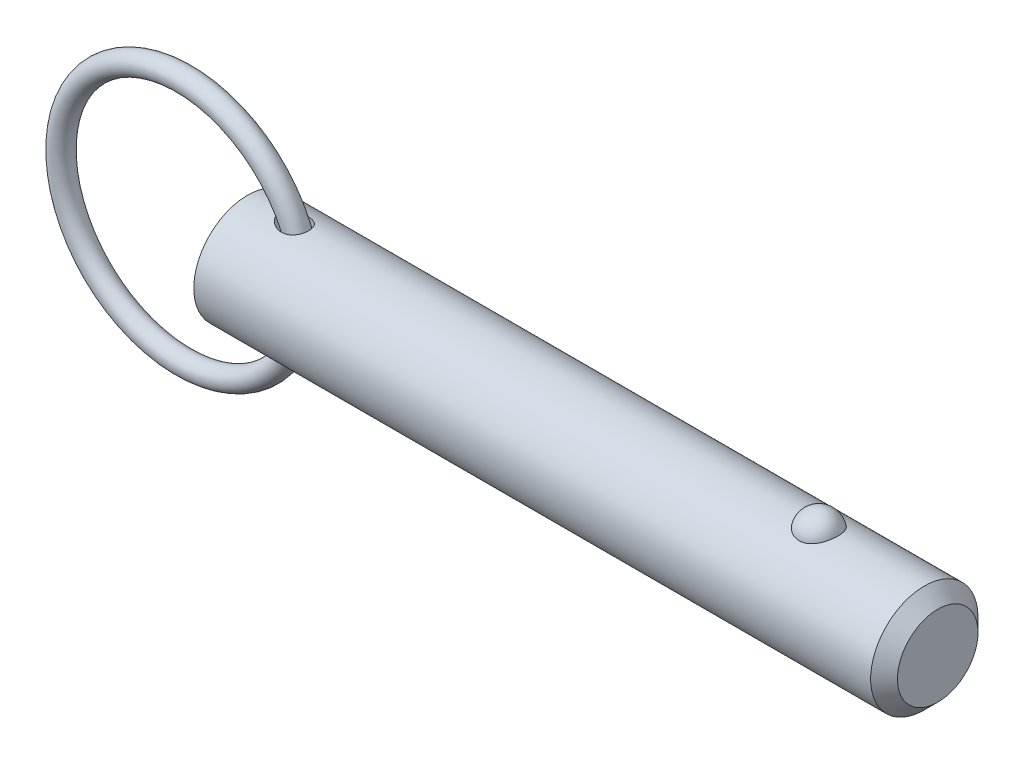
ISO-10303-21;
HEADER;
FILE_DESCRIPTION(('STEP AP214'),'2;1');
FILE_NAME('part.step','',(''),(''),'','','');
FILE_SCHEMA(('AUTOMOTIVE_DESIGN { 1 0 10303 214 1 1 1 1 }'));
ENDSEC;
DATA;
#1=APPLICATION_CONTEXT('core data for automotive mechanical design processes');
#2=APPLICATION_PROTOCOL_DEFINITION('international standard','automotive_design',2000,#1);
#3=PRODUCT_CONTEXT('',#1,'mechanical');
#4=PRODUCT('Part','Part','',(#3));
#5=PRODUCT_RELATED_PRODUCT_CATEGORY('part','',(#4));
#6=PRODUCT_DEFINITION_FORMATION('','',#4);
#7=PRODUCT_DEFINITION_CONTEXT('part definition',#1,'design');
#8=PRODUCT_DEFINITION('design','',#6,#7);
#9=PRODUCT_DEFINITION_SHAPE('','',#8);
#10=(LENGTH_UNIT() NAMED_UNIT(*) SI_UNIT(.MILLI.,.METRE.));
#11=(NAMED_UNIT(*) PLANE_ANGLE_UNIT() SI_UNIT($,.RADIAN.));
#12=(NAMED_UNIT(*) SI_UNIT($,.STERADIAN.) SOLID_ANGLE_UNIT());
#13=UNCERTAINTY_MEASURE_WITH_UNIT(LENGTH_MEASURE(1.E-05),#10,'distance_accuracy_value','');
#14=(GEOMETRIC_REPRESENTATION_CONTEXT(3) GLOBAL_UNCERTAINTY_ASSIGNED_CONTEXT((#13)) GLOBAL_UNIT_ASSIGNED_CONTEXT((#10,
#11,#12)) REPRESENTATION_CONTEXT('',''));
#15=CARTESIAN_POINT('',(0.,0.,0.));
#16=DIRECTION('',(0.,0.,1.));
#17=DIRECTION('',(1.,0.,0.));
#18=AXIS2_PLACEMENT_3D('',#15,#16,#17);
#19=CARTESIAN_POINT('',(-6.5973878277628,0.,0.));
#20=DIRECTION('',(0.,0.,1.));
#21=DIRECTION('',(1.,0.,0.));
#22=AXIS2_PLACEMENT_3D('',#19,#20,#21);
#23=TOROIDAL_SURFACE('',#22,12.7,1.111);
#24=CARTESIAN_POINT('',(7.21361217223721,0.,0.));
#25=VERTEX_POINT('',#24);
#26=VERTEX_LOOP('',#25);
#27=FACE_BOUND('',#26,.T.);
#28=ADVANCED_FACE('P0_F12',(#27),#23,.T.);
#29=CLOSED_SHELL('',(#28));
#30=MANIFOLD_SOLID_BREP('P0_B1',#29);
#31=CARTESIAN_POINT('',(0.,0.,0.));
#32=DIRECTION('',(1.,0.,0.));
#33=DIRECTION('',(0.,0.,-1.));
#34=AXIS2_PLACEMENT_3D('',#31,#32,#33);
#35=CYLINDRICAL_SURFACE('',#34,5.555);
#36=CARTESIAN_POINT('',(3.4079629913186,5.52646850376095,-0.562290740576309));
#37=CARTESIAN_POINT('',(3.45038002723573,5.51879026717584,-0.637753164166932));
#38=CARTESIAN_POINT('',(3.50032814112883,5.50998541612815,-0.708891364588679));
#39=CARTESIAN_POINT('',(3.61174203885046,5.49132550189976,-0.841353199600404));
#40=CARTESIAN_POINT('',(3.67323300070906,5.48146816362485,-0.902654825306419));
#41=CARTESIAN_POINT('',(3.80437942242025,5.46186986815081,-1.01449227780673));
#42=CARTESIAN_POINT('',(3.87396236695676,5.45212862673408,-1.06511378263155));
#43=CARTESIAN_POINT('',(4.01965973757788,5.43359578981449,-1.15594541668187));
#44=CARTESIAN_POINT('',(4.09577226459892,5.42480391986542,-1.19615855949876));
#45=CARTESIAN_POINT('',(4.26620236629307,5.40764958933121,-1.27165209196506));
#46=CARTESIAN_POINT('',(4.36143030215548,5.3996073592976,-1.30496908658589));
#47=CARTESIAN_POINT('',(4.55632904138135,5.38707461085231,-1.35578120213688));
#48=CARTESIAN_POINT('',(4.65600230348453,5.38258608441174,-1.37326745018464));
#49=CARTESIAN_POINT('',(4.85802759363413,5.37803111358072,-1.3910078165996));
#50=CARTESIAN_POINT('',(4.96039620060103,5.37800782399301,-1.39109376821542));
#51=CARTESIAN_POINT('',(5.16321961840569,5.38288845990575,-1.37209481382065));
#52=CARTESIAN_POINT('',(5.26367660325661,5.38778639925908,-1.3530331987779));
#53=CARTESIAN_POINT('',(5.44616808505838,5.40112654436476,-1.29866014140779));
#54=CARTESIAN_POINT('',(5.52893514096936,5.40904875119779,-1.26567968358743));
#55=CARTESIAN_POINT('',(5.68656142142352,5.4273273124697,-1.18484144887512));
#56=CARTESIAN_POINT('',(5.76142575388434,5.43768208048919,-1.13699336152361));
#57=CARTESIAN_POINT('',(5.8928378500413,5.45821422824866,-1.03362464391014));
#58=CARTESIAN_POINT('',(5.95048930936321,5.4682911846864,-0.979480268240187));
#59=CARTESIAN_POINT('',(6.05543937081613,5.48805232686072,-0.86188793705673));
#60=CARTESIAN_POINT('',(6.10274018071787,5.4977365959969,-0.798441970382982));
#61=CARTESIAN_POINT('',(6.18429732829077,5.51527779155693,-0.666351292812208));
#62=CARTESIAN_POINT('',(6.21893047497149,5.52318421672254,-0.597945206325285));
#63=CARTESIAN_POINT('',(6.27643902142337,5.53669785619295,-0.456146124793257));
#64=CARTESIAN_POINT('',(6.299314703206,5.54230512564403,-0.38275324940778));
#65=CARTESIAN_POINT('',(6.33280284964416,5.55061821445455,-0.232999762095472));
#66=CARTESIAN_POINT('',(6.34340498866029,5.55332159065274,-0.156636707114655));
#67=CARTESIAN_POINT('',(6.35208224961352,5.55552923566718,-0.00315477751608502));
#68=CARTESIAN_POINT('',(6.3501570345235,5.55503341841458,0.0739641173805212));
#69=CARTESIAN_POINT('',(6.33379320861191,5.55088854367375,0.227029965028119));
#70=CARTESIAN_POINT('',(6.31931424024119,5.54722931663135,0.302972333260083));
#71=CARTESIAN_POINT('',(6.27810810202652,5.53713917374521,0.451265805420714));
#72=CARTESIAN_POINT('',(6.25138106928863,5.53070828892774,0.52361694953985));
#73=CARTESIAN_POINT('',(6.18634700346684,5.51578851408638,0.662556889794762));
#74=CARTESIAN_POINT('',(6.14805666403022,5.50730259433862,0.729153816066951));
#75=CARTESIAN_POINT('',(6.0608417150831,5.4892059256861,0.854797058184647));
#76=CARTESIAN_POINT('',(6.01191805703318,5.47959527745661,0.913844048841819));
#77=CARTESIAN_POINT('',(5.90496974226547,5.46035411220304,1.0225462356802));
#78=CARTESIAN_POINT('',(5.84698163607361,5.45072382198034,1.07223745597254));
#79=CARTESIAN_POINT('',(5.72342907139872,5.43245016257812,1.16128533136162));
#80=CARTESIAN_POINT('',(5.65786492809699,5.42380675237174,1.20064241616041));
#81=CARTESIAN_POINT('',(5.52033184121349,5.40830592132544,1.26865612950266));
#82=CARTESIAN_POINT('',(5.44830127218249,5.40146883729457,1.2971923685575));
#83=CARTESIAN_POINT('',(5.30051649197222,5.39032432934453,1.34275086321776));
#84=CARTESIAN_POINT('',(5.22476137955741,5.38601752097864,1.35977031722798));
#85=CARTESIAN_POINT('',(5.06697568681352,5.38004503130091,1.3832203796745));
#86=CARTESIAN_POINT('',(4.98483834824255,5.37854992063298,1.38896799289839));
#87=CARTESIAN_POINT('',(4.82062075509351,5.37866467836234,1.38851901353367));
#88=CARTESIAN_POINT('',(4.73854053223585,5.38027567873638,1.38231806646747));
#89=CARTESIAN_POINT('',(4.56659703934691,5.38661928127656,1.35740374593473));
#90=CARTESIAN_POINT('',(4.47694676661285,5.39169506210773,1.33731128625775));
#91=CARTESIAN_POINT('',(4.30168169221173,5.40457769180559,1.28425210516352));
#92=CARTESIAN_POINT('',(4.2160714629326,5.41238755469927,1.25127117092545));
#93=CARTESIAN_POINT('',(4.04117722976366,5.43085841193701,1.16867508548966));
#94=CARTESIAN_POINT('',(3.95261220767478,5.44174460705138,1.11757796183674));
#95=CARTESIAN_POINT('',(3.78568183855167,5.46440376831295,1.00091858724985));
#96=CARTESIAN_POINT('',(3.70730710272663,5.47617590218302,0.935369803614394));
#97=CARTESIAN_POINT('',(3.5829937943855,5.49603821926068,0.809043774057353));
#98=CARTESIAN_POINT('',(3.5339020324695,5.50429522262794,0.751392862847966));
#99=CARTESIAN_POINT('',(3.44556991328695,5.51963490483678,0.628847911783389));
#100=CARTESIAN_POINT('',(3.4063138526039,5.52671944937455,0.56396565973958));
#101=CARTESIAN_POINT('',(3.34553998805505,5.5379053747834,0.439181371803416));
#102=CARTESIAN_POINT('',(3.32216705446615,5.5423057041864,0.380214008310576));
#103=CARTESIAN_POINT('',(3.2854368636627,5.54928356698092,0.259119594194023));
#104=CARTESIAN_POINT('',(3.27207322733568,5.5518622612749,0.196994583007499));
#105=CARTESIAN_POINT('',(3.25633559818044,5.5549036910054,0.0710541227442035));
#106=CARTESIAN_POINT('',(3.25400356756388,5.5553583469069,0.00723314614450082));
#107=CARTESIAN_POINT('',(3.26064251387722,5.55407150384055,-0.119787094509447));
#108=CARTESIAN_POINT('',(3.26961302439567,5.55233009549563,-0.182986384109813));
#109=CARTESIAN_POINT('',(3.29666795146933,5.54714559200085,-0.300518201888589));
#110=CARTESIAN_POINT('',(3.31373453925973,5.54389322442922,-0.355099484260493));
#111=CARTESIAN_POINT('',(3.35543396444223,5.53607951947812,-0.461174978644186));
#112=CARTESIAN_POINT('',(3.38007019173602,5.5315175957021,-0.512667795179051));
#113=CARTESIAN_POINT('',(3.4079629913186,5.52646850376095,-0.562290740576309));
#114=B_SPLINE_CURVE_WITH_KNOTS('',3,(#36,#37,#38,#39,#40,#41,#42,#43,#44,#45,#46,#47,#48,#49,
#50,#51,#52,#53,#54,#55,#56,#57,#58,#59,#60,#61,#62,#63,#64,#65,#66,#67,#68,#69,#70,#71,#72,#73,
#74,#75,#76,#77,#78,#79,#80,#81,#82,#83,#84,#85,#86,#87,#88,#89,#90,#91,#92,#93,#94,#95,#96,#97,
#98,#99,#100,#101,#102,#103,#104,#105,#106,#107,#108,#109,#110,#111,#112,#113),.UNSPECIFIED.,
.T.,.F.,(4,2,2,2,2,2,2,2,2,2,2,2,2,2,2,2,2,2,2,2,2,2,2,2,2,2,2,2,2,2,2,2,2,2,2,2,2,2,4),(0.,
0.260459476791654,0.521493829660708,0.780346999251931,1.03912513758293,1.34137402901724,
1.64379222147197,1.94913302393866,2.25410286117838,2.52092363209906,2.78757087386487,
3.0255756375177,3.26352958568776,3.49368251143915,3.72382991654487,3.95417080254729,
4.18451788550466,4.41560824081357,4.64669600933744,4.87745174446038,5.10818684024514,
5.33801446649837,5.56783253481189,5.80013729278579,6.03249854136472,6.27855081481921,
6.52469277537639,6.79963372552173,7.07487872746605,7.38193573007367,7.68870779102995,
7.91639390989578,8.14371416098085,8.33366541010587,8.52349549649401,8.71404708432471,
8.90459080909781,9.07578823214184,9.24706243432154),.UNSPECIFIED.);
#115=CARTESIAN_POINT('',(3.4079629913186,5.52646850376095,-0.562290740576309));
#116=VERTEX_POINT('',#115);
#117=EDGE_CURVE('P1_E40',#116,#116,#114,.T.);
#118=ORIENTED_EDGE('',*,*,#117,.T.);
#119=EDGE_LOOP('',(#118));
#120=FACE_BOUND('',#119,.T.);
#121=CARTESIAN_POINT('',(70.03125,0.,0.));
#122=DIRECTION('',(1.,0.,0.));
#123=DIRECTION('',(0.,0.,-1.));
#124=AXIS2_PLACEMENT_3D('',#121,#122,#123);
#125=CIRCLE('',#124,5.555);
#126=CARTESIAN_POINT('',(70.03125,0.,-5.555));
#127=VERTEX_POINT('',#126);
#128=EDGE_CURVE('P1_E25',#127,#127,#125,.T.);
#129=ORIENTED_EDGE('',*,*,#128,.F.);
#130=EDGE_LOOP('',(#129));
#131=FACE_BOUND('',#130,.T.);
#132=CARTESIAN_POINT('',(0.,0.,0.));
#133=DIRECTION('',(1.,0.,0.));
#134=DIRECTION('',(0.,0.,-1.));
#135=AXIS2_PLACEMENT_3D('',#132,#133,#134);
#136=CIRCLE('',#135,5.555);
#137=CARTESIAN_POINT('',(0.,0.,-5.555));
#138=VERTEX_POINT('',#137);
#139=EDGE_CURVE('P1_E9',#138,#138,#136,.T.);
#140=ORIENTED_EDGE('',*,*,#139,.T.);
#141=EDGE_LOOP('',(#140));
#142=FACE_BOUND('',#141,.T.);
#143=CARTESIAN_POINT('',(59.1186264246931,5.16741224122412,2.03859650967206));
#144=CARTESIAN_POINT('',(59.0129492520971,5.16740893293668,2.03859990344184));
#145=CARTESIAN_POINT('',(58.90729894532,5.17079470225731,2.03008306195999));
#146=CARTESIAN_POINT('',(58.6991419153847,5.18392795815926,1.99630721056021));
#147=CARTESIAN_POINT('',(58.5966344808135,5.19367399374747,1.97105201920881));
#148=CARTESIAN_POINT('',(58.3977710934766,5.21839168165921,1.90463997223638));
#149=CARTESIAN_POINT('',(58.3014064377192,5.23335573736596,1.86350622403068));
#150=CARTESIAN_POINT('',(58.1170804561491,5.26688076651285,1.76652592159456));
#151=CARTESIAN_POINT('',(58.0291207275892,5.28544242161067,1.71067657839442));
#152=CARTESIAN_POINT('',(57.861265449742,5.32479845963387,1.58399959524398));
#153=CARTESIAN_POINT('',(57.7816656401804,5.34564089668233,1.5127954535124));
#154=CARTESIAN_POINT('',(57.6351290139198,5.38697258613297,1.3582858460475));
#155=CARTESIAN_POINT('',(57.568194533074,5.40746177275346,1.27497815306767));
#156=CARTESIAN_POINT('',(57.4456103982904,5.44694508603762,1.09440293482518));
#157=CARTESIAN_POINT('',(57.3905989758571,5.46583143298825,0.996677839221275));
#158=CARTESIAN_POINT('',(57.2969376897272,5.49908030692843,0.792961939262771));
#159=CARTESIAN_POINT('',(57.2582894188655,5.513442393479,0.686970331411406));
#160=CARTESIAN_POINT('',(57.1976807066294,5.536358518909,0.468019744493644));
#161=CARTESIAN_POINT('',(57.1759725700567,5.54482455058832,0.354981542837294));
#162=CARTESIAN_POINT('',(57.1506362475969,5.55473324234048,0.126595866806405));
#163=CARTESIAN_POINT('',(57.1470077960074,5.55617600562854,0.0112484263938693));
#164=CARTESIAN_POINT('',(57.1578817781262,5.55189984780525,-0.218011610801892));
#165=CARTESIAN_POINT('',(57.1723151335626,5.54620821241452,-0.331928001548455));
#166=CARTESIAN_POINT('',(57.218903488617,5.52828920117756,-0.555544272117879));
#167=CARTESIAN_POINT('',(57.2510588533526,5.5160616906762,-0.665244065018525));
#168=CARTESIAN_POINT('',(57.3324883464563,5.48630779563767,-0.877469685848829));
#169=CARTESIAN_POINT('',(57.3817816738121,5.4687754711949,-0.979987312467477));
#170=CARTESIAN_POINT('',(57.4964785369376,5.43024700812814,-1.1748697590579));
#171=CARTESIAN_POINT('',(57.5618831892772,5.4092506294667,-1.26723387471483));
#172=CARTESIAN_POINT('',(57.7075712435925,5.36600927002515,-1.4394013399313));
#173=CARTESIAN_POINT('',(57.7878859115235,5.34376173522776,-1.51917763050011));
#174=CARTESIAN_POINT('',(57.9614520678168,5.30057971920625,-1.66360338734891));
#175=CARTESIAN_POINT('',(58.054702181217,5.27964509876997,-1.72825445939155));
#176=CARTESIAN_POINT('',(58.2493939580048,5.24205250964,-1.83909478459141));
#177=CARTESIAN_POINT('',(58.3505900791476,5.22530519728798,-1.88568407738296));
#178=CARTESIAN_POINT('',(58.5601552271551,5.19750919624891,-1.96100802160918));
#179=CARTESIAN_POINT('',(58.6685215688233,5.1864583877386,-1.98974931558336));
#180=CARTESIAN_POINT('',(58.8834989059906,5.17184410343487,-2.02742262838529));
#181=CARTESIAN_POINT('',(58.989925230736,5.16793282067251,-2.03727608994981));
#182=CARTESIAN_POINT('',(59.2029925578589,5.16698995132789,-2.03966777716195));
#183=CARTESIAN_POINT('',(59.3096335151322,5.16995704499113,-2.03220932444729));
#184=CARTESIAN_POINT('',(59.5167730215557,5.18222383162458,-2.00071170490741));
#185=CARTESIAN_POINT('',(59.6173599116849,5.19133213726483,-1.97717337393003));
#186=CARTESIAN_POINT('',(59.8130141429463,5.21467637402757,-1.91475248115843));
#187=CARTESIAN_POINT('',(59.9080810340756,5.22891272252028,-1.8758686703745));
#188=CARTESIAN_POINT('',(60.0923711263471,5.26137066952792,-1.78282713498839));
#189=CARTESIAN_POINT('',(60.1814190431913,5.27967329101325,-1.72835124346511));
#190=CARTESIAN_POINT('',(60.3492880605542,5.31817411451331,-1.6059748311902));
#191=CARTESIAN_POINT('',(60.4281068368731,5.33837274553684,-1.53807126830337));
#192=CARTESIAN_POINT('',(60.5775156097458,5.37968287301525,-1.38688970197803));
#193=CARTESIAN_POINT('',(60.6475058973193,5.40079011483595,-1.30301744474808));
#194=CARTESIAN_POINT('',(60.7730125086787,5.44074401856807,-1.12458170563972));
#195=CARTESIAN_POINT('',(60.8285262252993,5.4595902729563,-1.03001630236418));
#196=CARTESIAN_POINT('',(60.9255507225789,5.49369849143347,-0.829439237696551));
#197=CARTESIAN_POINT('',(60.9665483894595,5.50882422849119,-0.72315564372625));
#198=CARTESIAN_POINT('',(61.0311250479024,5.53310911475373,-0.504772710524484));
#199=CARTESIAN_POINT('',(61.0547036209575,5.54226812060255,-0.392673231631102));
#200=CARTESIAN_POINT('',(61.084013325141,5.55370358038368,-0.165459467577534));
#201=CARTESIAN_POINT('',(61.0896884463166,5.55595843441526,-0.0503368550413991));
#202=CARTESIAN_POINT('',(61.082916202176,5.55329317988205,0.17928866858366));
#203=CARTESIAN_POINT('',(61.0704690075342,5.54837313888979,0.293791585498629));
#204=CARTESIAN_POINT('',(61.0277798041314,5.53189037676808,0.518526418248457));
#205=CARTESIAN_POINT('',(60.997598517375,5.5203503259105,0.628771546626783));
#206=CARTESIAN_POINT('',(60.9200962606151,5.49182453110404,0.842318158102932));
#207=CARTESIAN_POINT('',(60.8727743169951,5.47483847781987,0.945619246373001));
#208=CARTESIAN_POINT('',(60.7617204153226,5.43710633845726,1.14281571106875));
#209=CARTESIAN_POINT('',(60.6979215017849,5.41634501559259,1.23667048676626));
#210=CARTESIAN_POINT('',(60.5553577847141,5.37334572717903,1.41185243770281));
#211=CARTESIAN_POINT('',(60.4765932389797,5.35110778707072,1.49317982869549));
#212=CARTESIAN_POINT('',(60.3064234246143,5.30779474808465,1.64049162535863));
#213=CARTESIAN_POINT('',(60.2151002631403,5.28671324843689,1.7065687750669));
#214=CARTESIAN_POINT('',(60.0217390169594,5.24804852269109,1.82201372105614));
#215=CARTESIAN_POINT('',(59.9197005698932,5.23046541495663,1.87138095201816));
#216=CARTESIAN_POINT('',(59.7036187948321,5.20042692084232,1.95335298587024));
#217=CARTESIAN_POINT('',(59.589260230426,5.18820192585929,1.98521734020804));
#218=CARTESIAN_POINT('',(59.3561307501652,5.17169804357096,2.02783294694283));
#219=CARTESIAN_POINT('',(59.2373616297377,5.16741595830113,2.03859269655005));
#220=CARTESIAN_POINT('',(59.1186264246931,5.16741224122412,2.03859650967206));
#221=B_SPLINE_CURVE_WITH_KNOTS('',3,(#143,#144,#145,#146,#147,#148,#149,#150,#151,#152,#153,
#154,#155,#156,#157,#158,#159,#160,#161,#162,#163,#164,#165,#166,#167,#168,#169,#170,#171,#172,
#173,#174,#175,#176,#177,#178,#179,#180,#181,#182,#183,#184,#185,#186,#187,#188,#189,#190,#191,
#192,#193,#194,#195,#196,#197,#198,#199,#200,#201,#202,#203,#204,#205,#206,#207,#208,#209,#210,
#211,#212,#213,#214,#215,#216,#217,#218,#219,#220),.UNSPECIFIED.,.T.,.F.,(4,2,2,2,2,2,2,2,2,2,2,
2,2,2,2,2,2,2,2,2,2,2,2,2,2,2,2,2,2,2,2,2,2,2,2,2,2,2,4),(0.,0.316595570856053,
0.633118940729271,0.949183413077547,1.26530783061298,1.59030762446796,1.91536729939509,
2.25495824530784,2.59458224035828,2.93917283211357,3.28375835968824,3.62703002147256,
3.97030875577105,4.31397329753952,4.65766166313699,5.00207904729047,5.34645984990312,
5.68270547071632,6.01882587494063,6.33808403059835,6.65728093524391,6.96696376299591,
7.27667180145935,7.59321535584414,7.90983070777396,8.24210387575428,8.57443684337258,
8.91755896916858,9.26068933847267,9.604892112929,9.94909164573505,10.2921194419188,
10.6351667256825,10.9796305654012,11.3240884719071,11.6663928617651,12.0087088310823,
12.3645679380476,12.7202837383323),.UNSPECIFIED.);
#222=CARTESIAN_POINT('',(59.1186264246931,5.16741224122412,2.03859650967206));
#223=VERTEX_POINT('',#222);
#224=EDGE_CURVE('P1_E34',#223,#223,#221,.T.);
#225=ORIENTED_EDGE('',*,*,#224,.T.);
#226=EDGE_LOOP('',(#225));
#227=FACE_BOUND('',#226,.T.);
#228=CARTESIAN_POINT('',(3.4079629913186,-5.52646850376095,-0.562290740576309));
#229=CARTESIAN_POINT('',(3.37716927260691,-5.53204268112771,-0.50750716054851));
#230=CARTESIAN_POINT('',(3.35034276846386,-5.53702335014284,-0.450440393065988));
#231=CARTESIAN_POINT('',(3.30606625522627,-5.54534377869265,-0.332655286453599));
#232=CARTESIAN_POINT('',(3.28860803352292,-5.5486849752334,-0.27194019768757));
#233=CARTESIAN_POINT('',(3.2642120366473,-5.55337514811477,-0.148013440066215));
#234=CARTESIAN_POINT('',(3.25732647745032,-5.55471423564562,-0.0847909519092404));
#235=CARTESIAN_POINT('',(3.25480623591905,-5.5552029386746,0.0418913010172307));
#236=CARTESIAN_POINT('',(3.25917102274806,-5.55435265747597,0.105351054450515));
#237=CARTESIAN_POINT('',(3.27824306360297,-5.55067444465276,0.227039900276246));
#238=CARTESIAN_POINT('',(3.29237198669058,-5.54795714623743,0.285365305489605));
#239=CARTESIAN_POINT('',(3.32941044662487,-5.54094262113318,0.399033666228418));
#240=CARTESIAN_POINT('',(3.35232235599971,-5.53664496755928,0.454375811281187));
#241=CARTESIAN_POINT('',(3.40768868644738,-5.52648234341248,0.565099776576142));
#242=CARTESIAN_POINT('',(3.44072521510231,-5.52052470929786,0.620179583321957));
#243=CARTESIAN_POINT('',(3.51400705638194,-5.50771567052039,0.725188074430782));
#244=CARTESIAN_POINT('',(3.55425830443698,-5.50086353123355,0.775112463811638));
#245=CARTESIAN_POINT('',(3.66122818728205,-5.48337209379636,0.891977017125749));
#246=CARTESIAN_POINT('',(3.73142715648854,-5.47248221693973,0.955709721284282));
#247=CARTESIAN_POINT('',(3.88137100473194,-5.45112279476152,1.07085228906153));
#248=CARTESIAN_POINT('',(3.96113047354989,-5.44065392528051,1.12224294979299));
#249=CARTESIAN_POINT('',(4.12858826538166,-5.42121387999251,1.2126934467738));
#250=CARTESIAN_POINT('',(4.21635930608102,-5.41225908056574,1.25162207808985));
#251=CARTESIAN_POINT('',(4.39702156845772,-5.39704895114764,1.31566440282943));
#252=CARTESIAN_POINT('',(4.48991226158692,-5.39079334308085,1.34077951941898));
#253=CARTESIAN_POINT('',(4.68604255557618,-5.38154547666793,1.37745897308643));
#254=CARTESIAN_POINT('',(4.78952677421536,-5.37884317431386,1.38782444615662));
#255=CARTESIAN_POINT('',(4.9967070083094,-5.3783992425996,1.38955482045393));
#256=CARTESIAN_POINT('',(5.10040282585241,-5.380654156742,1.380932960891));
#257=CARTESIAN_POINT('',(5.29344112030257,-5.3896561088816,1.34533259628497));
#258=CARTESIAN_POINT('',(5.38316618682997,-5.39591960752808,1.32032381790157));
#259=CARTESIAN_POINT('',(5.55593681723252,-5.41176992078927,1.25376768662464));
#260=CARTESIAN_POINT('',(5.63898852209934,-5.42135363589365,1.2122357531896));
#261=CARTESIAN_POINT('',(5.78518175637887,-5.4411584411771,1.1197110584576));
#262=CARTESIAN_POINT('',(5.84951468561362,-5.45115126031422,1.07054233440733));
#263=CARTESIAN_POINT('',(5.96832363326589,-5.47143247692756,0.961516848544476));
#264=CARTESIAN_POINT('',(6.02280238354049,-5.48172079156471,0.901663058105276));
#265=CARTESIAN_POINT('',(6.11773365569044,-5.50082367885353,0.776380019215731));
#266=CARTESIAN_POINT('',(6.15876077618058,-5.50968670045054,0.71139212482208));
#267=CARTESIAN_POINT('',(6.22940016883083,-5.52555592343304,0.57527808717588));
#268=CARTESIAN_POINT('',(6.25901321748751,-5.53256225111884,0.504152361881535));
#269=CARTESIAN_POINT('',(6.30603044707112,-5.54392803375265,0.358090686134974));
#270=CARTESIAN_POINT('',(6.32348246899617,-5.54829785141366,0.283170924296));
#271=CARTESIAN_POINT('',(6.34598368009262,-5.5539654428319,0.131376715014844));
#272=CARTESIAN_POINT('',(6.35103253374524,-5.55526313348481,0.0545022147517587));
#273=CARTESIAN_POINT('',(6.34861245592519,-5.55464639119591,-0.0993401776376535));
#274=CARTESIAN_POINT('',(6.34109421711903,-5.5527193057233,-0.176307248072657));
#275=CARTESIAN_POINT('',(6.31360904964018,-5.54583593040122,-0.327847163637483));
#276=CARTESIAN_POINT('',(6.29364207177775,-5.54087962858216,-0.402419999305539));
#277=CARTESIAN_POINT('',(6.24170966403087,-5.52847553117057,-0.547041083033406));
#278=CARTESIAN_POINT('',(6.20974488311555,-5.52102787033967,-0.617089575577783));
#279=CARTESIAN_POINT('',(6.13458425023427,-5.5044595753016,-0.750655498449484));
#280=CARTESIAN_POINT('',(6.09138916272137,-5.49533905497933,-0.814173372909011));
#281=CARTESIAN_POINT('',(5.99508306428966,-5.47647644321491,-0.932642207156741));
#282=CARTESIAN_POINT('',(5.94201288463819,-5.46673701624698,-0.98762679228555));
#283=CARTESIAN_POINT('',(5.82732079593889,-5.4476756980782,-1.08787197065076));
#284=CARTESIAN_POINT('',(5.76569959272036,-5.43835377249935,-1.133133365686));
#285=CARTESIAN_POINT('',(5.63545565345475,-5.42108746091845,-1.2130627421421));
#286=CARTESIAN_POINT('',(5.56680798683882,-5.41314827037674,-1.24769112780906));
#287=CARTESIAN_POINT('',(5.42470366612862,-5.39946749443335,-1.30562834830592));
#288=CARTESIAN_POINT('',(5.35124627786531,-5.39372624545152,-1.32893545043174));
#289=CARTESIAN_POINT('',(5.19834649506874,-5.38471871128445,-1.36498831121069));
#290=CARTESIAN_POINT('',(5.11878242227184,-5.38156800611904,-1.37724301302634));
#291=CARTESIAN_POINT('',(4.95867408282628,-5.37830368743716,-1.38993264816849));
#292=CARTESIAN_POINT('',(4.87812945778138,-5.37819121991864,-1.39036312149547));
#293=CARTESIAN_POINT('',(4.70952450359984,-5.38096665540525,-1.37958681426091));
#294=CARTESIAN_POINT('',(4.62154757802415,-5.38416579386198,-1.36717293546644));
#295=CARTESIAN_POINT('',(4.44844201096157,-5.39350862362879,-1.32983172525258));
#296=CARTESIAN_POINT('',(4.36331534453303,-5.39965431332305,-1.30489590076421));
#297=CARTESIAN_POINT('',(4.18705584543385,-5.41508127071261,-1.23943340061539));
#298=CARTESIAN_POINT('',(4.09653169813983,-5.42466147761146,-1.19732979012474));
#299=CARTESIAN_POINT('',(3.92355621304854,-5.44542654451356,-1.09903394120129));
#300=CARTESIAN_POINT('',(3.84111059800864,-5.45661252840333,-1.0428318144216));
#301=CARTESIAN_POINT('',(3.69303712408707,-5.47835672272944,-0.921492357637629));
#302=CARTESIAN_POINT('',(3.62661543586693,-5.4888999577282,-0.857326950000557));
#303=CARTESIAN_POINT('',(3.50663841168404,-5.50887375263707,-0.71781545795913));
#304=CARTESIAN_POINT('',(3.45304856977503,-5.51830726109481,-0.642500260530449));
#305=CARTESIAN_POINT('',(3.4079629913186,-5.52646850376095,-0.562290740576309));
#306=B_SPLINE_CURVE_WITH_KNOTS('',3,(#228,#229,#230,#231,#232,#233,#234,#235,#236,#237,#238,
#239,#240,#241,#242,#243,#244,#245,#246,#247,#248,#249,#250,#251,#252,#253,#254,#255,#256,#257,
#258,#259,#260,#261,#262,#263,#264,#265,#266,#267,#268,#269,#270,#271,#272,#273,#274,#275,#276,
#277,#278,#279,#280,#281,#282,#283,#284,#285,#286,#287,#288,#289,#290,#291,#292,#293,#294,#295,
#296,#297,#298,#299,#300,#301,#302,#303,#304,#305),.UNSPECIFIED.,.T.,.F.,(4,2,2,2,2,2,2,2,2,2,2,
2,2,2,2,2,2,2,2,2,2,2,2,2,2,2,2,2,2,2,2,2,2,2,2,2,2,2,4),(0.,0.189054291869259,
0.377942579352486,0.567760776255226,0.757570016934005,0.937004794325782,1.11648807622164,
1.30929480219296,1.50226088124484,1.78704908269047,2.07227755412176,2.3604171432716,
2.64852704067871,2.95892962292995,3.26911584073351,3.5475451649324,3.82571526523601,
4.06921935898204,4.31265584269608,4.54364944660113,4.77462733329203,5.00469135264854,
5.234761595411,5.46573664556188,5.6967126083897,5.92767607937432,6.15862383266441,
6.38863707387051,6.61863134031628,6.84947196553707,7.08034790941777,7.32103794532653,
7.56181876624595,7.82747997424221,8.09332161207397,8.39289891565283,8.6926869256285,
8.97023931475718,9.24703674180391),.UNSPECIFIED.);
#307=CARTESIAN_POINT('',(3.4079629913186,-5.52646850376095,-0.562290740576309));
#308=VERTEX_POINT('',#307);
#309=EDGE_CURVE('P1_E17',#308,#308,#306,.T.);
#310=ORIENTED_EDGE('',*,*,#309,.T.);
#311=EDGE_LOOP('',(#310));
#312=FACE_BOUND('',#311,.T.);
#313=ADVANCED_FACE('P1_F13',(#120,#131,#142,#227,#312),#35,.T.);
#314=CARTESIAN_POINT('',(0.,0.,0.));
#315=DIRECTION('',(-1.,0.,0.));
#316=DIRECTION('',(0.,0.,1.));
#317=AXIS2_PLACEMENT_3D('',#314,#315,#316);
#318=PLANE('',#317);
#319=ORIENTED_EDGE('',*,*,#139,.F.);
#320=EDGE_LOOP('',(#319));
#321=FACE_BOUND('',#320,.T.);
#322=ADVANCED_FACE('P1_F15',(#321),#318,.T.);
#323=CARTESIAN_POINT('',(71.42,0.,0.));
#324=DIRECTION('',(-1.,0.,0.));
#325=DIRECTION('',(0.,0.,1.));
#326=AXIS2_PLACEMENT_3D('',#323,#324,#325);
#327=CONICAL_SURFACE('',#326,4.16625000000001,0.785398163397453);
#328=ORIENTED_EDGE('',*,*,#128,.T.);
#329=EDGE_LOOP('',(#328));
#330=FACE_BOUND('',#329,.T.);
#331=CARTESIAN_POINT('',(71.42,0.,0.));
#332=DIRECTION('',(1.,0.,0.));
#333=DIRECTION('',(0.,0.,-1.));
#334=AXIS2_PLACEMENT_3D('',#331,#332,#333);
#335=CIRCLE('',#334,4.16625000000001);
#336=CARTESIAN_POINT('',(71.42,0.,-4.16625000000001));
#337=VERTEX_POINT('',#336);
#338=EDGE_CURVE('P1_E30',#337,#337,#335,.T.);
#339=ORIENTED_EDGE('',*,*,#338,.F.);
#340=EDGE_LOOP('',(#339));
#341=FACE_BOUND('',#340,.T.);
#342=ADVANCED_FACE('P1_F55',(#330,#341),#327,.T.);
#343=CARTESIAN_POINT('',(71.42,4.16625000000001,0.));
#344=DIRECTION('',(1.,0.,0.));
#345=DIRECTION('',(0.,0.,-1.));
#346=AXIS2_PLACEMENT_3D('',#343,#344,#345);
#347=PLANE('',#346);
#348=ORIENTED_EDGE('',*,*,#338,.T.);
#349=EDGE_LOOP('',(#348));
#350=FACE_BOUND('',#349,.T.);
#351=ADVANCED_FACE('P1_F51',(#350),#347,.T.);
#352=CARTESIAN_POINT('',(59.1186264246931,4.9995,0.));
#353=DIRECTION('',(-1.,0.,0.));
#354=DIRECTION('',(0.,1.,0.));
#355=AXIS2_PLACEMENT_3D('',#352,#353,#354);
#356=SPHERICAL_SURFACE('',#355,2.0455);
#357=ORIENTED_EDGE('',*,*,#224,.F.);
#358=EDGE_LOOP('',(#357));
#359=FACE_BOUND('',#358,.T.);
#360=ADVANCED_FACE('P1_F46',(#359),#356,.T.);
#361=CARTESIAN_POINT('',(-6.59738782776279,0.,0.));
#362=DIRECTION('',(0.,0.,1.));
#363=DIRECTION('',(1.,0.,0.));
#364=AXIS2_PLACEMENT_3D('',#361,#362,#363);
#365=TOROIDAL_SURFACE('',#364,12.7,1.38875);
#366=ORIENTED_EDGE('',*,*,#309,.F.);
#367=EDGE_LOOP('',(#366));
#368=FACE_BOUND('',#367,.T.);
#369=ORIENTED_EDGE('',*,*,#117,.F.);
#370=EDGE_LOOP('',(#369));
#371=FACE_BOUND('',#370,.T.);
#372=ADVANCED_FACE('P1_F50',(#368,#371),#365,.F.);
#373=CLOSED_SHELL('',(#313,#322,#342,#351,#360,#372));
#374=MANIFOLD_SOLID_BREP('P1_B1',#373);
#375=ADVANCED_BREP_SHAPE_REPRESENTATION('',(#18,#30,#374),#14);
#376=SHAPE_DEFINITION_REPRESENTATION(#9,#375);
ENDSEC;
END-ISO-10303-21;
